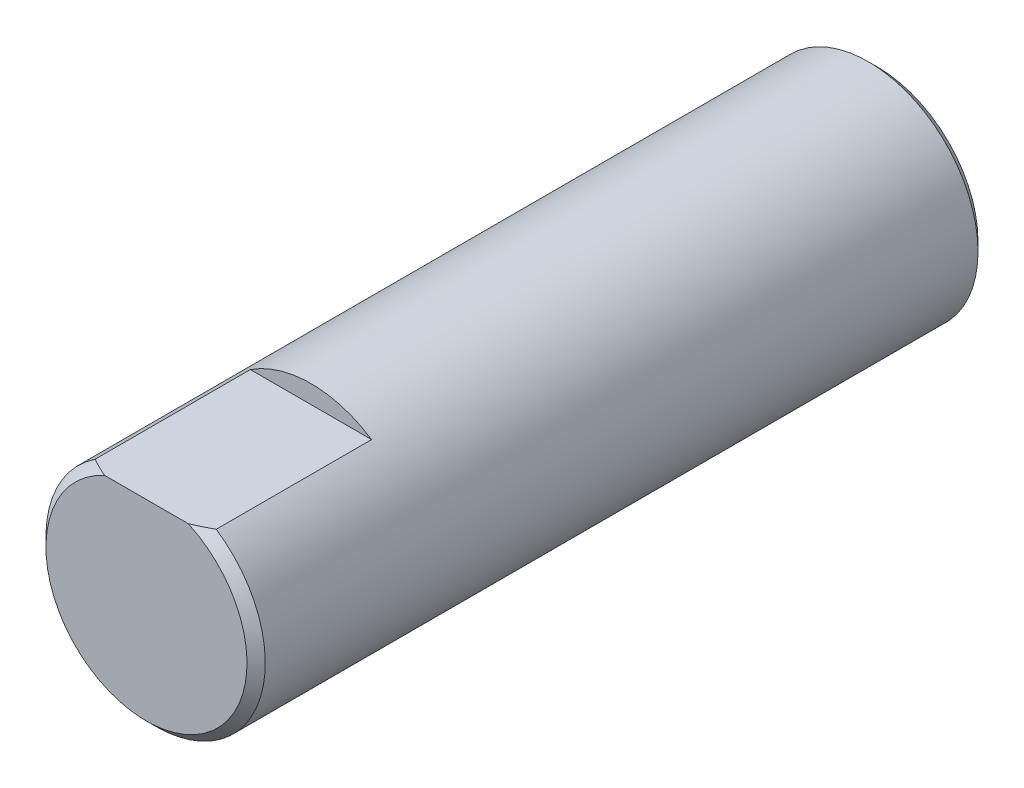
from build123d import *

# Parameters (mm, degrees)
ESQUISSE1_R             = 6
EXTRUSION1_DEPTH        = 20
CHANFREIN1_SIZE         = 0.5
ENL_V_MAT_EXTRU_1_DEPTH = 9


with BuildPart() as part:
    # Esquisse1 → Extrusion1 (new, symmetric)
    with BuildSketch(Plane.XY):
        Circle(ESQUISSE1_R)
    extrude(amount=EXTRUSION1_DEPTH, both=True)

    # Chanfrein1
    chanfrein1_edges = [part.edges().sort_by_distance(p)[0] for p in [
        (-6, 0, -20),
        (-6, 0, 20),
    ]]
    chamfer(chanfrein1_edges, length=CHANFREIN1_SIZE)

    # Esquisse2 → Enl_v. mat.-Extru.1 (cut)
    with BuildSketch(Plane.XY.offset(20)):
        with BuildLine():
            Line((-3.31662479, 5), (3.31662479, 5))
            ThreePointArc((3.31662479, 5), (0, 6), (-3.31662479, 5))
        make_face()
    extrude(amount=-ENL_V_MAT_EXTRU_1_DEPTH, mode=Mode.SUBTRACT)


solid = part.part
